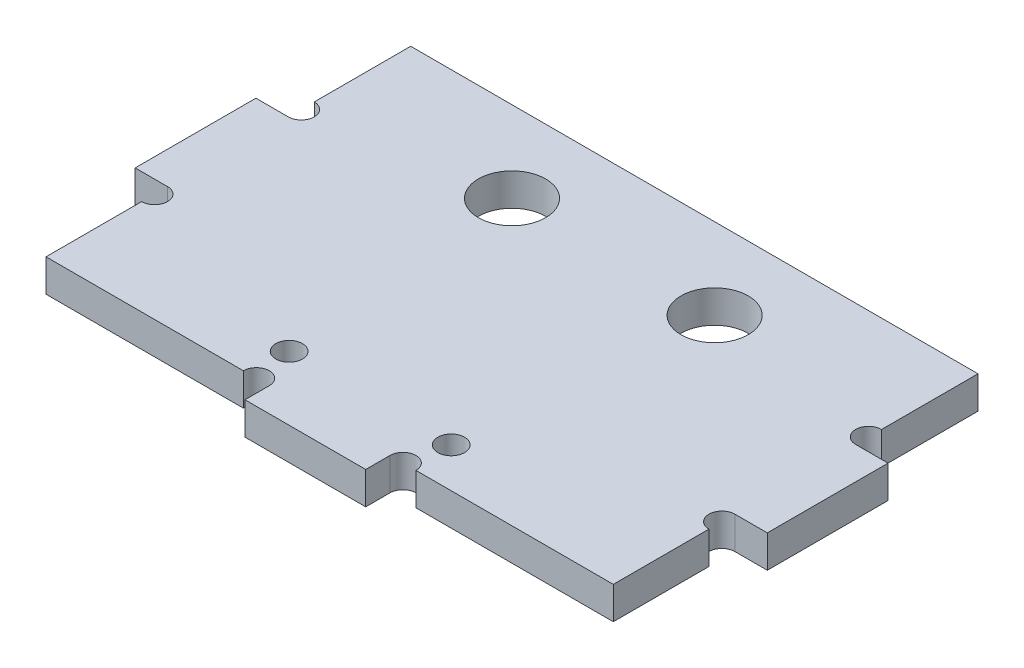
ISO-10303-21;
HEADER;
FILE_DESCRIPTION(('STEP AP214'),'2;1');
FILE_NAME('part.step','',(''),(''),'','','');
FILE_SCHEMA(('AUTOMOTIVE_DESIGN { 1 0 10303 214 1 1 1 1 }'));
ENDSEC;
DATA;
#1=APPLICATION_CONTEXT('core data for automotive mechanical design processes');
#2=APPLICATION_PROTOCOL_DEFINITION('international standard','automotive_design',2000,#1);
#3=PRODUCT_CONTEXT('',#1,'mechanical');
#4=PRODUCT('Part','Part','',(#3));
#5=PRODUCT_RELATED_PRODUCT_CATEGORY('part','',(#4));
#6=PRODUCT_DEFINITION_FORMATION('','',#4);
#7=PRODUCT_DEFINITION_CONTEXT('part definition',#1,'design');
#8=PRODUCT_DEFINITION('design','',#6,#7);
#9=PRODUCT_DEFINITION_SHAPE('','',#8);
#10=(LENGTH_UNIT() NAMED_UNIT(*) SI_UNIT(.MILLI.,.METRE.));
#11=(NAMED_UNIT(*) PLANE_ANGLE_UNIT() SI_UNIT($,.RADIAN.));
#12=(NAMED_UNIT(*) SI_UNIT($,.STERADIAN.) SOLID_ANGLE_UNIT());
#13=UNCERTAINTY_MEASURE_WITH_UNIT(LENGTH_MEASURE(1.E-05),#10,'distance_accuracy_value','');
#14=(GEOMETRIC_REPRESENTATION_CONTEXT(3) GLOBAL_UNCERTAINTY_ASSIGNED_CONTEXT((#13)) GLOBAL_UNIT_ASSIGNED_CONTEXT((#10,
#11,#12)) REPRESENTATION_CONTEXT('',''));
#15=CARTESIAN_POINT('',(0.,0.,0.));
#16=DIRECTION('',(0.,0.,1.));
#17=DIRECTION('',(1.,0.,0.));
#18=AXIS2_PLACEMENT_3D('',#15,#16,#17);
#19=CARTESIAN_POINT('',(70.,-6.,-13.4));
#20=DIRECTION('',(0.,1.,0.));
#21=DIRECTION('',(0.,0.,1.));
#22=AXIS2_PLACEMENT_3D('',#19,#20,#21);
#23=CYLINDRICAL_SURFACE('',#22,1.6);
#24=CARTESIAN_POINT('',(70.,0.,-13.4));
#25=DIRECTION('',(0.,1.,0.));
#26=DIRECTION('',(0.,0.,1.));
#27=AXIS2_PLACEMENT_3D('',#24,#25,#26);
#28=CIRCLE('',#27,1.6);
#29=CARTESIAN_POINT('',(70.,0.,-15.));
#30=VERTEX_POINT('',#29);
#31=CARTESIAN_POINT('',(70.,0.,-11.8));
#32=VERTEX_POINT('',#31);
#33=EDGE_CURVE('E243',#30,#32,#28,.T.);
#34=ORIENTED_EDGE('',*,*,#33,.F.);
#35=DIRECTION('',(0.,-1.,0.));
#36=VECTOR('',#35,1.);
#37=CARTESIAN_POINT('',(70.,4.,-15.));
#38=LINE('',#37,#36);
#39=CARTESIAN_POINT('',(70.,4.,-15.));
#40=VERTEX_POINT('',#39);
#41=EDGE_CURVE('E459',#40,#30,#38,.T.);
#42=ORIENTED_EDGE('',*,*,#41,.F.);
#43=CARTESIAN_POINT('',(70.,4.,-13.4));
#44=DIRECTION('',(0.,1.,0.));
#45=DIRECTION('',(0.,0.,1.));
#46=AXIS2_PLACEMENT_3D('',#43,#44,#45);
#47=CIRCLE('',#46,1.6);
#48=CARTESIAN_POINT('',(70.,4.,-11.8));
#49=VERTEX_POINT('',#48);
#50=EDGE_CURVE('E349',#40,#49,#47,.T.);
#51=ORIENTED_EDGE('',*,*,#50,.T.);
#52=DIRECTION('',(0.,1.,0.));
#53=VECTOR('',#52,1.);
#54=CARTESIAN_POINT('',(70.,-6.,-11.8));
#55=LINE('',#54,#53);
#56=EDGE_CURVE('E401',#32,#49,#55,.T.);
#57=ORIENTED_EDGE('',*,*,#56,.F.);
#58=EDGE_LOOP('',(#34,#42,#51,#57));
#59=FACE_BOUND('',#58,.T.);
#60=ADVANCED_FACE('F17',(#59),#23,.F.);
#61=CARTESIAN_POINT('',(70.,-6.,-31.5));
#62=DIRECTION('',(0.,1.,0.));
#63=DIRECTION('',(0.,0.,1.));
#64=AXIS2_PLACEMENT_3D('',#61,#62,#63);
#65=CYLINDRICAL_SURFACE('',#64,1.6);
#66=CARTESIAN_POINT('',(70.,0.,-31.5));
#67=DIRECTION('',(0.,1.,0.));
#68=DIRECTION('',(0.,0.,1.));
#69=AXIS2_PLACEMENT_3D('',#66,#67,#68);
#70=CIRCLE('',#69,1.6);
#71=CARTESIAN_POINT('',(70.,0.,-33.1));
#72=VERTEX_POINT('',#71);
#73=CARTESIAN_POINT('',(70.,0.,-29.9));
#74=VERTEX_POINT('',#73);
#75=EDGE_CURVE('E254',#72,#74,#70,.T.);
#76=ORIENTED_EDGE('',*,*,#75,.F.);
#77=DIRECTION('',(0.,-1.,0.));
#78=VECTOR('',#77,1.);
#79=CARTESIAN_POINT('',(70.,-6.,-33.1));
#80=LINE('',#79,#78);
#81=CARTESIAN_POINT('',(70.,4.,-33.1));
#82=VERTEX_POINT('',#81);
#83=EDGE_CURVE('E271',#82,#72,#80,.T.);
#84=ORIENTED_EDGE('',*,*,#83,.F.);
#85=CARTESIAN_POINT('',(70.,4.,-31.5));
#86=DIRECTION('',(0.,1.,0.));
#87=DIRECTION('',(0.,0.,1.));
#88=AXIS2_PLACEMENT_3D('',#85,#86,#87);
#89=CIRCLE('',#88,1.6);
#90=CARTESIAN_POINT('',(70.,4.,-29.9));
#91=VERTEX_POINT('',#90);
#92=EDGE_CURVE('E352',#82,#91,#89,.T.);
#93=ORIENTED_EDGE('',*,*,#92,.T.);
#94=DIRECTION('',(0.,-1.,0.));
#95=VECTOR('',#94,1.);
#96=CARTESIAN_POINT('',(70.,4.,-29.9));
#97=LINE('',#96,#95);
#98=EDGE_CURVE('E473',#91,#74,#97,.T.);
#99=ORIENTED_EDGE('',*,*,#98,.T.);
#100=EDGE_LOOP('',(#76,#84,#93,#99));
#101=FACE_BOUND('',#100,.T.);
#102=ADVANCED_FACE('F550',(#101),#65,.F.);
#103=CARTESIAN_POINT('',(0.,-6.,-31.5));
#104=DIRECTION('',(0.,1.,0.));
#105=DIRECTION('',(0.,0.,1.));
#106=AXIS2_PLACEMENT_3D('',#103,#104,#105);
#107=CYLINDRICAL_SURFACE('',#106,1.6);
#108=DIRECTION('',(0.,-1.,0.));
#109=VECTOR('',#108,1.);
#110=CARTESIAN_POINT('',(0.,-6.,-33.1));
#111=LINE('',#110,#109);
#112=CARTESIAN_POINT('',(0.,4.,-33.1));
#113=VERTEX_POINT('',#112);
#114=CARTESIAN_POINT('',(0.,0.,-33.1));
#115=VERTEX_POINT('',#114);
#116=EDGE_CURVE('E301',#113,#115,#111,.T.);
#117=ORIENTED_EDGE('',*,*,#116,.T.);
#118=CARTESIAN_POINT('',(0.,0.,-31.5));
#119=DIRECTION('',(0.,1.,0.));
#120=DIRECTION('',(0.,0.,1.));
#121=AXIS2_PLACEMENT_3D('',#118,#119,#120);
#122=CIRCLE('',#121,1.6);
#123=CARTESIAN_POINT('',(0.,0.,-29.9));
#124=VERTEX_POINT('',#123);
#125=EDGE_CURVE('E251',#124,#115,#122,.T.);
#126=ORIENTED_EDGE('',*,*,#125,.F.);
#127=DIRECTION('',(0.,-1.,0.));
#128=VECTOR('',#127,1.);
#129=CARTESIAN_POINT('',(0.,4.,-29.9));
#130=LINE('',#129,#128);
#131=CARTESIAN_POINT('',(0.,4.,-29.9));
#132=VERTEX_POINT('',#131);
#133=EDGE_CURVE('E287',#132,#124,#130,.T.);
#134=ORIENTED_EDGE('',*,*,#133,.F.);
#135=CARTESIAN_POINT('',(0.,4.,-31.5));
#136=DIRECTION('',(0.,1.,0.));
#137=DIRECTION('',(0.,0.,1.));
#138=AXIS2_PLACEMENT_3D('',#135,#136,#137);
#139=CIRCLE('',#138,1.6);
#140=EDGE_CURVE('E357',#132,#113,#139,.T.);
#141=ORIENTED_EDGE('',*,*,#140,.T.);
#142=EDGE_LOOP('',(#117,#126,#134,#141));
#143=FACE_BOUND('',#142,.T.);
#144=ADVANCED_FACE('F19',(#143),#107,.F.);
#145=CARTESIAN_POINT('',(0.,-6.,-13.4));
#146=DIRECTION('',(0.,1.,0.));
#147=DIRECTION('',(0.,0.,1.));
#148=AXIS2_PLACEMENT_3D('',#145,#146,#147);
#149=CYLINDRICAL_SURFACE('',#148,1.6);
#150=DIRECTION('',(0.,1.,0.));
#151=VECTOR('',#150,1.);
#152=CARTESIAN_POINT('',(0.,-6.,-11.8));
#153=LINE('',#152,#151);
#154=CARTESIAN_POINT('',(0.,0.,-11.8));
#155=VERTEX_POINT('',#154);
#156=CARTESIAN_POINT('',(0.,4.,-11.8));
#157=VERTEX_POINT('',#156);
#158=EDGE_CURVE('E337',#155,#157,#153,.T.);
#159=ORIENTED_EDGE('',*,*,#158,.T.);
#160=CARTESIAN_POINT('',(0.,4.,-13.4));
#161=DIRECTION('',(0.,1.,0.));
#162=DIRECTION('',(0.,0.,1.));
#163=AXIS2_PLACEMENT_3D('',#160,#161,#162);
#164=CIRCLE('',#163,1.6);
#165=CARTESIAN_POINT('',(0.,4.,-15.));
#166=VERTEX_POINT('',#165);
#167=EDGE_CURVE('E358',#157,#166,#164,.T.);
#168=ORIENTED_EDGE('',*,*,#167,.T.);
#169=DIRECTION('',(0.,-1.,0.));
#170=VECTOR('',#169,1.);
#171=CARTESIAN_POINT('',(0.,4.,-15.));
#172=LINE('',#171,#170);
#173=CARTESIAN_POINT('',(0.,0.,-15.));
#174=VERTEX_POINT('',#173);
#175=EDGE_CURVE('E329',#166,#174,#172,.T.);
#176=ORIENTED_EDGE('',*,*,#175,.T.);
#177=CARTESIAN_POINT('',(0.,0.,-13.4));
#178=DIRECTION('',(0.,1.,0.));
#179=DIRECTION('',(0.,0.,1.));
#180=AXIS2_PLACEMENT_3D('',#177,#178,#179);
#181=CIRCLE('',#180,1.6);
#182=EDGE_CURVE('E250',#155,#174,#181,.T.);
#183=ORIENTED_EDGE('',*,*,#182,.F.);
#184=EDGE_LOOP('',(#159,#168,#176,#183));
#185=FACE_BOUND('',#184,.T.);
#186=ADVANCED_FACE('F559',(#185),#149,.F.);
#187=CARTESIAN_POINT('',(25.95,-6.,0.));
#188=DIRECTION('',(0.,1.,0.));
#189=DIRECTION('',(0.,0.,1.));
#190=AXIS2_PLACEMENT_3D('',#187,#188,#189);
#191=CYLINDRICAL_SURFACE('',#190,1.6);
#192=CARTESIAN_POINT('',(25.95,0.,0.));
#193=DIRECTION('',(0.,1.,0.));
#194=DIRECTION('',(0.,0.,1.));
#195=AXIS2_PLACEMENT_3D('',#192,#193,#194);
#196=CIRCLE('',#195,1.6);
#197=CARTESIAN_POINT('',(27.55,0.,0.));
#198=VERTEX_POINT('',#197);
#199=CARTESIAN_POINT('',(24.35,0.,0.));
#200=VERTEX_POINT('',#199);
#201=EDGE_CURVE('E247',#198,#200,#196,.T.);
#202=ORIENTED_EDGE('',*,*,#201,.F.);
#203=DIRECTION('',(0.,1.,0.));
#204=VECTOR('',#203,1.);
#205=CARTESIAN_POINT('',(27.55,0.,0.));
#206=LINE('',#205,#204);
#207=CARTESIAN_POINT('',(27.55,4.,0.));
#208=VERTEX_POINT('',#207);
#209=EDGE_CURVE('E40',#198,#208,#206,.T.);
#210=ORIENTED_EDGE('',*,*,#209,.T.);
#211=CARTESIAN_POINT('',(25.95,4.,0.));
#212=DIRECTION('',(0.,1.,0.));
#213=DIRECTION('',(0.,0.,1.));
#214=AXIS2_PLACEMENT_3D('',#211,#212,#213);
#215=CIRCLE('',#214,1.6);
#216=CARTESIAN_POINT('',(24.35,4.,0.));
#217=VERTEX_POINT('',#216);
#218=EDGE_CURVE('E361',#208,#217,#215,.T.);
#219=ORIENTED_EDGE('',*,*,#218,.T.);
#220=DIRECTION('',(0.,1.,0.));
#221=VECTOR('',#220,1.);
#222=CARTESIAN_POINT('',(24.35,-6.,0.));
#223=LINE('',#222,#221);
#224=EDGE_CURVE('E433',#200,#217,#223,.T.);
#225=ORIENTED_EDGE('',*,*,#224,.F.);
#226=EDGE_LOOP('',(#202,#210,#219,#225));
#227=FACE_BOUND('',#226,.T.);
#228=ADVANCED_FACE('F561',(#227),#191,.F.);
#229=CARTESIAN_POINT('',(44.05,-6.,0.));
#230=DIRECTION('',(0.,1.,0.));
#231=DIRECTION('',(0.,0.,1.));
#232=AXIS2_PLACEMENT_3D('',#229,#230,#231);
#233=CYLINDRICAL_SURFACE('',#232,1.6);
#234=CARTESIAN_POINT('',(44.05,4.,0.));
#235=DIRECTION('',(0.,1.,0.));
#236=DIRECTION('',(0.,0.,1.));
#237=AXIS2_PLACEMENT_3D('',#234,#235,#236);
#238=CIRCLE('',#237,1.6);
#239=CARTESIAN_POINT('',(45.65,4.,0.));
#240=VERTEX_POINT('',#239);
#241=CARTESIAN_POINT('',(42.45,4.,0.));
#242=VERTEX_POINT('',#241);
#243=EDGE_CURVE('E366',#240,#242,#238,.T.);
#244=ORIENTED_EDGE('',*,*,#243,.T.);
#245=DIRECTION('',(0.,1.,0.));
#246=VECTOR('',#245,1.);
#247=CARTESIAN_POINT('',(42.45,0.,0.));
#248=LINE('',#247,#246);
#249=CARTESIAN_POINT('',(42.45,0.,0.));
#250=VERTEX_POINT('',#249);
#251=EDGE_CURVE('E11',#250,#242,#248,.T.);
#252=ORIENTED_EDGE('',*,*,#251,.F.);
#253=CARTESIAN_POINT('',(44.05,0.,0.));
#254=DIRECTION('',(0.,1.,0.));
#255=DIRECTION('',(0.,0.,1.));
#256=AXIS2_PLACEMENT_3D('',#253,#254,#255);
#257=CIRCLE('',#256,1.6);
#258=CARTESIAN_POINT('',(45.65,0.,0.));
#259=VERTEX_POINT('',#258);
#260=EDGE_CURVE('E236',#259,#250,#257,.T.);
#261=ORIENTED_EDGE('',*,*,#260,.F.);
#262=DIRECTION('',(0.,-1.,0.));
#263=VECTOR('',#262,1.);
#264=CARTESIAN_POINT('',(45.65,-6.,0.));
#265=LINE('',#264,#263);
#266=EDGE_CURVE('E407',#240,#259,#265,.T.);
#267=ORIENTED_EDGE('',*,*,#266,.F.);
#268=EDGE_LOOP('',(#244,#252,#261,#267));
#269=FACE_BOUND('',#268,.T.);
#270=ADVANCED_FACE('F557',(#269),#233,.F.);
#271=CARTESIAN_POINT('',(27.55,0.,3.));
#272=DIRECTION('',(0.,0.,1.));
#273=DIRECTION('',(1.,0.,0.));
#274=AXIS2_PLACEMENT_3D('',#271,#272,#273);
#275=PLANE('',#274);
#276=DIRECTION('',(1.,0.,0.));
#277=VECTOR('',#276,1.);
#278=CARTESIAN_POINT('',(27.55,4.,3.));
#279=LINE('',#278,#277);
#280=CARTESIAN_POINT('',(27.55,4.,3.));
#281=VERTEX_POINT('',#280);
#282=CARTESIAN_POINT('',(42.45,4.,3.));
#283=VERTEX_POINT('',#282);
#284=EDGE_CURVE('E367',#281,#283,#279,.T.);
#285=ORIENTED_EDGE('',*,*,#284,.F.);
#286=DIRECTION('',(0.,1.,0.));
#287=VECTOR('',#286,1.);
#288=CARTESIAN_POINT('',(27.55,0.,3.));
#289=LINE('',#288,#287);
#290=CARTESIAN_POINT('',(27.55,0.,3.));
#291=VERTEX_POINT('',#290);
#292=EDGE_CURVE('E224',#291,#281,#289,.T.);
#293=ORIENTED_EDGE('',*,*,#292,.F.);
#294=DIRECTION('',(1.,0.,0.));
#295=VECTOR('',#294,1.);
#296=CARTESIAN_POINT('',(27.55,0.,3.));
#297=LINE('',#296,#295);
#298=CARTESIAN_POINT('',(42.45,0.,3.));
#299=VERTEX_POINT('',#298);
#300=EDGE_CURVE('E226',#291,#299,#297,.T.);
#301=ORIENTED_EDGE('',*,*,#300,.T.);
#302=DIRECTION('',(0.,1.,0.));
#303=VECTOR('',#302,1.);
#304=CARTESIAN_POINT('',(42.45,0.,3.));
#305=LINE('',#304,#303);
#306=EDGE_CURVE('E27',#299,#283,#305,.T.);
#307=ORIENTED_EDGE('',*,*,#306,.T.);
#308=EDGE_LOOP('',(#285,#293,#301,#307));
#309=FACE_BOUND('',#308,.T.);
#310=ADVANCED_FACE('F227',(#309),#275,.T.);
#311=CARTESIAN_POINT('',(42.45,0.,0.));
#312=DIRECTION('',(1.,0.,0.));
#313=DIRECTION('',(0.,1.,0.));
#314=AXIS2_PLACEMENT_3D('',#311,#312,#313);
#315=PLANE('',#314);
#316=DIRECTION('',(0.,0.,-1.));
#317=VECTOR('',#316,1.);
#318=CARTESIAN_POINT('',(42.45,4.,0.));
#319=LINE('',#318,#317);
#320=EDGE_CURVE('E219',#283,#242,#319,.T.);
#321=ORIENTED_EDGE('',*,*,#320,.F.);
#322=ORIENTED_EDGE('',*,*,#306,.F.);
#323=DIRECTION('',(0.,0.,-1.));
#324=VECTOR('',#323,1.);
#325=CARTESIAN_POINT('',(42.45,0.,0.));
#326=LINE('',#325,#324);
#327=EDGE_CURVE('E216',#299,#250,#326,.T.);
#328=ORIENTED_EDGE('',*,*,#327,.T.);
#329=ORIENTED_EDGE('',*,*,#251,.T.);
#330=EDGE_LOOP('',(#321,#322,#328,#329));
#331=FACE_BOUND('',#330,.T.);
#332=ADVANCED_FACE('F214',(#331),#315,.T.);
#333=CARTESIAN_POINT('',(27.55,0.,0.));
#334=DIRECTION('',(-1.,0.,0.));
#335=DIRECTION('',(0.,0.,1.));
#336=AXIS2_PLACEMENT_3D('',#333,#334,#335);
#337=PLANE('',#336);
#338=DIRECTION('',(0.,0.,1.));
#339=VECTOR('',#338,1.);
#340=CARTESIAN_POINT('',(27.55,4.,0.));
#341=LINE('',#340,#339);
#342=EDGE_CURVE('E364',#208,#281,#341,.T.);
#343=ORIENTED_EDGE('',*,*,#342,.F.);
#344=ORIENTED_EDGE('',*,*,#209,.F.);
#345=DIRECTION('',(0.,0.,1.));
#346=VECTOR('',#345,1.);
#347=CARTESIAN_POINT('',(27.55,0.,0.));
#348=LINE('',#347,#346);
#349=EDGE_CURVE('E231',#198,#291,#348,.T.);
#350=ORIENTED_EDGE('',*,*,#349,.T.);
#351=ORIENTED_EDGE('',*,*,#292,.T.);
#352=EDGE_LOOP('',(#343,#344,#350,#351));
#353=FACE_BOUND('',#352,.T.);
#354=ADVANCED_FACE('F587',(#353),#337,.T.);
#355=CARTESIAN_POINT('',(0.,0.,0.));
#356=DIRECTION('',(0.,1.,0.));
#357=DIRECTION('',(1.,0.,0.));
#358=AXIS2_PLACEMENT_3D('',#355,#356,#357);
#359=PLANE('',#358);
#360=CARTESIAN_POINT('',(22.5,0.,-35.));
#361=DIRECTION('',(0.,1.,0.));
#362=DIRECTION('',(0.,0.,1.));
#363=AXIS2_PLACEMENT_3D('',#360,#361,#362);
#364=CIRCLE('',#363,4.15);
#365=CARTESIAN_POINT('',(22.5,0.,-30.85));
#366=VERTEX_POINT('',#365);
#367=EDGE_CURVE('E381',#366,#366,#364,.T.);
#368=ORIENTED_EDGE('',*,*,#367,.T.);
#369=EDGE_LOOP('',(#368));
#370=FACE_BOUND('',#369,.T.);
#371=CARTESIAN_POINT('',(47.5,0.,-35.));
#372=DIRECTION('',(0.,1.,0.));
#373=DIRECTION('',(0.,0.,1.));
#374=AXIS2_PLACEMENT_3D('',#371,#372,#373);
#375=CIRCLE('',#374,4.15);
#376=CARTESIAN_POINT('',(47.5,0.,-30.85));
#377=VERTEX_POINT('',#376);
#378=EDGE_CURVE('E389',#377,#377,#375,.T.);
#379=ORIENTED_EDGE('',*,*,#378,.T.);
#380=EDGE_LOOP('',(#379));
#381=FACE_BOUND('',#380,.T.);
#382=CARTESIAN_POINT('',(45.100000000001,0.,-4.90000000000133));
#383=DIRECTION('',(0.,1.,0.));
#384=DIRECTION('',(0.,0.,1.));
#385=AXIS2_PLACEMENT_3D('',#382,#383,#384);
#386=CIRCLE('',#385,1.65);
#387=CARTESIAN_POINT('',(45.100000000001,0.,-3.25000000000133));
#388=VERTEX_POINT('',#387);
#389=EDGE_CURVE('E506',#388,#388,#386,.T.);
#390=ORIENTED_EDGE('',*,*,#389,.T.);
#391=EDGE_LOOP('',(#390));
#392=FACE_BOUND('',#391,.T.);
#393=CARTESIAN_POINT('',(25.100000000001,0.,-4.90000000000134));
#394=DIRECTION('',(0.,1.,0.));
#395=DIRECTION('',(0.,0.,1.));
#396=AXIS2_PLACEMENT_3D('',#393,#394,#395);
#397=CIRCLE('',#396,1.65);
#398=CARTESIAN_POINT('',(25.100000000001,0.,-3.25000000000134));
#399=VERTEX_POINT('',#398);
#400=EDGE_CURVE('E490',#399,#399,#397,.T.);
#401=ORIENTED_EDGE('',*,*,#400,.T.);
#402=EDGE_LOOP('',(#401));
#403=FACE_BOUND('',#402,.T.);
#404=DIRECTION('',(1.,0.,0.));
#405=VECTOR('',#404,1.);
#406=CARTESIAN_POINT('',(0.,0.,-15.));
#407=LINE('',#406,#405);
#408=CARTESIAN_POINT('',(74.,0.,-15.));
#409=VERTEX_POINT('',#408);
#410=EDGE_CURVE('E447',#30,#409,#407,.T.);
#411=ORIENTED_EDGE('',*,*,#410,.F.);
#412=ORIENTED_EDGE('',*,*,#33,.T.);
#413=DIRECTION('',(0.,0.,-1.));
#414=VECTOR('',#413,1.);
#415=CARTESIAN_POINT('',(70.,0.,0.));
#416=LINE('',#415,#414);
#417=CARTESIAN_POINT('',(70.,0.,0.));
#418=VERTEX_POINT('',#417);
#419=EDGE_CURVE('E397',#418,#32,#416,.T.);
#420=ORIENTED_EDGE('',*,*,#419,.F.);
#421=DIRECTION('',(1.,0.,0.));
#422=VECTOR('',#421,1.);
#423=CARTESIAN_POINT('',(0.,0.,0.));
#424=LINE('',#423,#422);
#425=EDGE_CURVE('E412',#259,#418,#424,.T.);
#426=ORIENTED_EDGE('',*,*,#425,.F.);
#427=ORIENTED_EDGE('',*,*,#260,.T.);
#428=ORIENTED_EDGE('',*,*,#327,.F.);
#429=ORIENTED_EDGE('',*,*,#300,.F.);
#430=ORIENTED_EDGE('',*,*,#349,.F.);
#431=ORIENTED_EDGE('',*,*,#201,.T.);
#432=DIRECTION('',(1.,0.,0.));
#433=VECTOR('',#432,1.);
#434=CARTESIAN_POINT('',(0.,0.,0.));
#435=LINE('',#434,#433);
#436=CARTESIAN_POINT('',(0.,0.,0.));
#437=VERTEX_POINT('',#436);
#438=EDGE_CURVE('E429',#437,#200,#435,.T.);
#439=ORIENTED_EDGE('',*,*,#438,.F.);
#440=DIRECTION('',(0.,0.,-1.));
#441=VECTOR('',#440,1.);
#442=CARTESIAN_POINT('',(0.,0.,0.));
#443=LINE('',#442,#441);
#444=EDGE_CURVE('E341',#437,#155,#443,.T.);
#445=ORIENTED_EDGE('',*,*,#444,.T.);
#446=ORIENTED_EDGE('',*,*,#182,.T.);
#447=DIRECTION('',(-1.,0.,0.));
#448=VECTOR('',#447,1.);
#449=CARTESIAN_POINT('',(0.,0.,-15.));
#450=LINE('',#449,#448);
#451=CARTESIAN_POINT('',(-4.,0.,-15.));
#452=VERTEX_POINT('',#451);
#453=EDGE_CURVE('E327',#174,#452,#450,.T.);
#454=ORIENTED_EDGE('',*,*,#453,.T.);
#455=DIRECTION('',(0.,0.,-1.));
#456=VECTOR('',#455,1.);
#457=CARTESIAN_POINT('',(-4.,0.,0.));
#458=LINE('',#457,#456);
#459=CARTESIAN_POINT('',(-4.,0.,-29.9));
#460=VERTEX_POINT('',#459);
#461=EDGE_CURVE('E291',#452,#460,#458,.T.);
#462=ORIENTED_EDGE('',*,*,#461,.T.);
#463=DIRECTION('',(-1.,0.,0.));
#464=VECTOR('',#463,1.);
#465=CARTESIAN_POINT('',(0.,0.,-29.9));
#466=LINE('',#465,#464);
#467=EDGE_CURVE('E311',#124,#460,#466,.T.);
#468=ORIENTED_EDGE('',*,*,#467,.F.);
#469=ORIENTED_EDGE('',*,*,#125,.T.);
#470=DIRECTION('',(0.,0.,-1.));
#471=VECTOR('',#470,1.);
#472=CARTESIAN_POINT('',(0.,0.,0.));
#473=LINE('',#472,#471);
#474=CARTESIAN_POINT('',(0.,0.,-45.));
#475=VERTEX_POINT('',#474);
#476=EDGE_CURVE('E308',#115,#475,#473,.T.);
#477=ORIENTED_EDGE('',*,*,#476,.T.);
#478=DIRECTION('',(1.,0.,0.));
#479=VECTOR('',#478,1.);
#480=CARTESIAN_POINT('',(0.,0.,-45.));
#481=LINE('',#480,#479);
#482=CARTESIAN_POINT('',(70.,0.,-45.));
#483=VERTEX_POINT('',#482);
#484=EDGE_CURVE('E283',#475,#483,#481,.T.);
#485=ORIENTED_EDGE('',*,*,#484,.T.);
#486=DIRECTION('',(0.,0.,-1.));
#487=VECTOR('',#486,1.);
#488=CARTESIAN_POINT('',(70.,0.,0.));
#489=LINE('',#488,#487);
#490=EDGE_CURVE('E275',#72,#483,#489,.T.);
#491=ORIENTED_EDGE('',*,*,#490,.F.);
#492=ORIENTED_EDGE('',*,*,#75,.T.);
#493=DIRECTION('',(1.,0.,0.));
#494=VECTOR('',#493,1.);
#495=CARTESIAN_POINT('',(0.,0.,-29.9));
#496=LINE('',#495,#494);
#497=CARTESIAN_POINT('',(74.,0.,-29.9));
#498=VERTEX_POINT('',#497);
#499=EDGE_CURVE('E471',#74,#498,#496,.T.);
#500=ORIENTED_EDGE('',*,*,#499,.T.);
#501=DIRECTION('',(0.,0.,-1.));
#502=VECTOR('',#501,1.);
#503=CARTESIAN_POINT('',(74.,0.,0.));
#504=LINE('',#503,#502);
#505=EDGE_CURVE('E388',#409,#498,#504,.T.);
#506=ORIENTED_EDGE('',*,*,#505,.F.);
#507=EDGE_LOOP('',(#411,#412,#420,#426,#427,#428,#429,#430,#431,#439,#445,#446,#454,#462,#468,
#469,#477,#485,#491,#492,#500,#506));
#508=FACE_BOUND('',#507,.T.);
#509=ADVANCED_FACE('F234',(#370,#381,#392,#403,#508),#359,.F.);
#510=CARTESIAN_POINT('',(0.,4.,0.));
#511=DIRECTION('',(0.,1.,0.));
#512=DIRECTION('',(1.,0.,0.));
#513=AXIS2_PLACEMENT_3D('',#510,#511,#512);
#514=PLANE('',#513);
#515=CARTESIAN_POINT('',(22.5,4.,-35.));
#516=DIRECTION('',(0.,1.,0.));
#517=DIRECTION('',(0.,0.,1.));
#518=AXIS2_PLACEMENT_3D('',#515,#516,#517);
#519=CIRCLE('',#518,4.15);
#520=CARTESIAN_POINT('',(22.5,4.,-30.85));
#521=VERTEX_POINT('',#520);
#522=EDGE_CURVE('E408',#521,#521,#519,.T.);
#523=ORIENTED_EDGE('',*,*,#522,.F.);
#524=EDGE_LOOP('',(#523));
#525=FACE_BOUND('',#524,.T.);
#526=CARTESIAN_POINT('',(47.5,4.,-35.));
#527=DIRECTION('',(0.,1.,0.));
#528=DIRECTION('',(0.,0.,1.));
#529=AXIS2_PLACEMENT_3D('',#526,#527,#528);
#530=CIRCLE('',#529,4.15);
#531=CARTESIAN_POINT('',(47.5,4.,-30.85));
#532=VERTEX_POINT('',#531);
#533=EDGE_CURVE('E393',#532,#532,#530,.T.);
#534=ORIENTED_EDGE('',*,*,#533,.F.);
#535=EDGE_LOOP('',(#534));
#536=FACE_BOUND('',#535,.T.);
#537=CARTESIAN_POINT('',(45.100000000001,4.,-4.90000000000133));
#538=DIRECTION('',(0.,1.,0.));
#539=DIRECTION('',(0.,0.,1.));
#540=AXIS2_PLACEMENT_3D('',#537,#538,#539);
#541=CIRCLE('',#540,1.65);
#542=CARTESIAN_POINT('',(45.100000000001,4.,-3.25000000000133));
#543=VERTEX_POINT('',#542);
#544=EDGE_CURVE('E394',#543,#543,#541,.T.);
#545=ORIENTED_EDGE('',*,*,#544,.F.);
#546=EDGE_LOOP('',(#545));
#547=FACE_BOUND('',#546,.T.);
#548=CARTESIAN_POINT('',(25.100000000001,4.,-4.90000000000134));
#549=DIRECTION('',(0.,1.,0.));
#550=DIRECTION('',(0.,0.,1.));
#551=AXIS2_PLACEMENT_3D('',#548,#549,#550);
#552=CIRCLE('',#551,1.65);
#553=CARTESIAN_POINT('',(25.100000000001,4.,-3.25000000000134));
#554=VERTEX_POINT('',#553);
#555=EDGE_CURVE('E494',#554,#554,#552,.T.);
#556=ORIENTED_EDGE('',*,*,#555,.F.);
#557=EDGE_LOOP('',(#556));
#558=FACE_BOUND('',#557,.T.);
#559=ORIENTED_EDGE('',*,*,#50,.F.);
#560=DIRECTION('',(1.,0.,0.));
#561=VECTOR('',#560,1.);
#562=CARTESIAN_POINT('',(0.,4.,-15.));
#563=LINE('',#562,#561);
#564=CARTESIAN_POINT('',(74.,4.,-15.));
#565=VERTEX_POINT('',#564);
#566=EDGE_CURVE('E455',#40,#565,#563,.T.);
#567=ORIENTED_EDGE('',*,*,#566,.T.);
#568=DIRECTION('',(0.,0.,-1.));
#569=VECTOR('',#568,1.);
#570=CARTESIAN_POINT('',(74.,4.,0.));
#571=LINE('',#570,#569);
#572=CARTESIAN_POINT('',(74.,4.,-29.9));
#573=VERTEX_POINT('',#572);
#574=EDGE_CURVE('E387',#565,#573,#571,.T.);
#575=ORIENTED_EDGE('',*,*,#574,.T.);
#576=DIRECTION('',(1.,0.,0.));
#577=VECTOR('',#576,1.);
#578=CARTESIAN_POINT('',(0.,4.,-29.9));
#579=LINE('',#578,#577);
#580=EDGE_CURVE('E475',#91,#573,#579,.T.);
#581=ORIENTED_EDGE('',*,*,#580,.F.);
#582=ORIENTED_EDGE('',*,*,#92,.F.);
#583=DIRECTION('',(0.,0.,-1.));
#584=VECTOR('',#583,1.);
#585=CARTESIAN_POINT('',(70.,4.,0.));
#586=LINE('',#585,#584);
#587=CARTESIAN_POINT('',(70.,4.,-45.));
#588=VERTEX_POINT('',#587);
#589=EDGE_CURVE('E269',#82,#588,#586,.T.);
#590=ORIENTED_EDGE('',*,*,#589,.T.);
#591=DIRECTION('',(1.,0.,0.));
#592=VECTOR('',#591,1.);
#593=CARTESIAN_POINT('',(0.,4.,-45.));
#594=LINE('',#593,#592);
#595=CARTESIAN_POINT('',(0.,4.,-45.));
#596=VERTEX_POINT('',#595);
#597=EDGE_CURVE('E296',#596,#588,#594,.T.);
#598=ORIENTED_EDGE('',*,*,#597,.F.);
#599=DIRECTION('',(0.,0.,-1.));
#600=VECTOR('',#599,1.);
#601=CARTESIAN_POINT('',(0.,4.,0.));
#602=LINE('',#601,#600);
#603=EDGE_CURVE('E305',#113,#596,#602,.T.);
#604=ORIENTED_EDGE('',*,*,#603,.F.);
#605=ORIENTED_EDGE('',*,*,#140,.F.);
#606=DIRECTION('',(-1.,0.,0.));
#607=VECTOR('',#606,1.);
#608=CARTESIAN_POINT('',(0.,4.,-29.9));
#609=LINE('',#608,#607);
#610=CARTESIAN_POINT('',(-4.,4.,-29.9));
#611=VERTEX_POINT('',#610);
#612=EDGE_CURVE('E292',#132,#611,#609,.T.);
#613=ORIENTED_EDGE('',*,*,#612,.T.);
#614=DIRECTION('',(0.,0.,-1.));
#615=VECTOR('',#614,1.);
#616=CARTESIAN_POINT('',(-4.,4.,0.));
#617=LINE('',#616,#615);
#618=CARTESIAN_POINT('',(-4.,4.,-15.));
#619=VERTEX_POINT('',#618);
#620=EDGE_CURVE('E324',#619,#611,#617,.T.);
#621=ORIENTED_EDGE('',*,*,#620,.F.);
#622=DIRECTION('',(-1.,0.,0.));
#623=VECTOR('',#622,1.);
#624=CARTESIAN_POINT('',(0.,4.,-15.));
#625=LINE('',#624,#623);
#626=EDGE_CURVE('E334',#166,#619,#625,.T.);
#627=ORIENTED_EDGE('',*,*,#626,.F.);
#628=ORIENTED_EDGE('',*,*,#167,.F.);
#629=DIRECTION('',(0.,0.,-1.));
#630=VECTOR('',#629,1.);
#631=CARTESIAN_POINT('',(0.,4.,0.));
#632=LINE('',#631,#630);
#633=CARTESIAN_POINT('',(0.,4.,0.));
#634=VERTEX_POINT('',#633);
#635=EDGE_CURVE('E345',#634,#157,#632,.T.);
#636=ORIENTED_EDGE('',*,*,#635,.F.);
#637=DIRECTION('',(1.,0.,0.));
#638=VECTOR('',#637,1.);
#639=CARTESIAN_POINT('',(0.,4.,0.));
#640=LINE('',#639,#638);
#641=EDGE_CURVE('E416',#634,#217,#640,.T.);
#642=ORIENTED_EDGE('',*,*,#641,.T.);
#643=ORIENTED_EDGE('',*,*,#218,.F.);
#644=ORIENTED_EDGE('',*,*,#342,.T.);
#645=ORIENTED_EDGE('',*,*,#284,.T.);
#646=ORIENTED_EDGE('',*,*,#320,.T.);
#647=ORIENTED_EDGE('',*,*,#243,.F.);
#648=DIRECTION('',(1.,0.,0.));
#649=VECTOR('',#648,1.);
#650=CARTESIAN_POINT('',(0.,4.,0.));
#651=LINE('',#650,#649);
#652=CARTESIAN_POINT('',(70.,4.,0.));
#653=VERTEX_POINT('',#652);
#654=EDGE_CURVE('E403',#240,#653,#651,.T.);
#655=ORIENTED_EDGE('',*,*,#654,.T.);
#656=DIRECTION('',(0.,0.,-1.));
#657=VECTOR('',#656,1.);
#658=CARTESIAN_POINT('',(70.,4.,0.));
#659=LINE('',#658,#657);
#660=EDGE_CURVE('E443',#653,#49,#659,.T.);
#661=ORIENTED_EDGE('',*,*,#660,.T.);
#662=EDGE_LOOP('',(#559,#567,#575,#581,#582,#590,#598,#604,#605,#613,#621,#627,#628,#636,#642,
#643,#644,#645,#646,#647,#655,#661));
#663=FACE_BOUND('',#662,.T.);
#664=ADVANCED_FACE('F518',(#525,#536,#547,#558,#663),#514,.T.);
#665=CARTESIAN_POINT('',(0.,4.,0.));
#666=DIRECTION('',(-1.,0.,0.));
#667=DIRECTION('',(0.,0.,1.));
#668=AXIS2_PLACEMENT_3D('',#665,#666,#667);
#669=PLANE('',#668);
#670=ORIENTED_EDGE('',*,*,#158,.F.);
#671=ORIENTED_EDGE('',*,*,#444,.F.);
#672=DIRECTION('',(0.,-1.,0.));
#673=VECTOR('',#672,1.);
#674=CARTESIAN_POINT('',(0.,4.,0.));
#675=LINE('',#674,#673);
#676=EDGE_CURVE('E402',#634,#437,#675,.T.);
#677=ORIENTED_EDGE('',*,*,#676,.F.);
#678=ORIENTED_EDGE('',*,*,#635,.T.);
#679=EDGE_LOOP('',(#670,#671,#677,#678));
#680=FACE_BOUND('',#679,.T.);
#681=ADVANCED_FACE('F521',(#680),#669,.T.);
#682=CARTESIAN_POINT('',(0.,4.,-15.));
#683=DIRECTION('',(0.,0.,1.));
#684=DIRECTION('',(1.,0.,0.));
#685=AXIS2_PLACEMENT_3D('',#682,#683,#684);
#686=PLANE('',#685);
#687=ORIENTED_EDGE('',*,*,#453,.F.);
#688=ORIENTED_EDGE('',*,*,#175,.F.);
#689=ORIENTED_EDGE('',*,*,#626,.T.);
#690=DIRECTION('',(0.,-1.,0.));
#691=VECTOR('',#690,1.);
#692=CARTESIAN_POINT('',(-4.,4.,-15.));
#693=LINE('',#692,#691);
#694=EDGE_CURVE('E320',#619,#452,#693,.T.);
#695=ORIENTED_EDGE('',*,*,#694,.T.);
#696=EDGE_LOOP('',(#687,#688,#689,#695));
#697=FACE_BOUND('',#696,.T.);
#698=ADVANCED_FACE('F580',(#697),#686,.T.);
#699=CARTESIAN_POINT('',(-4.,4.,0.));
#700=DIRECTION('',(-1.,0.,0.));
#701=DIRECTION('',(0.,0.,1.));
#702=AXIS2_PLACEMENT_3D('',#699,#700,#701);
#703=PLANE('',#702);
#704=ORIENTED_EDGE('',*,*,#461,.F.);
#705=ORIENTED_EDGE('',*,*,#694,.F.);
#706=ORIENTED_EDGE('',*,*,#620,.T.);
#707=DIRECTION('',(0.,-1.,0.));
#708=VECTOR('',#707,1.);
#709=CARTESIAN_POINT('',(-4.,4.,-29.9));
#710=LINE('',#709,#708);
#711=EDGE_CURVE('E300',#611,#460,#710,.T.);
#712=ORIENTED_EDGE('',*,*,#711,.T.);
#713=EDGE_LOOP('',(#704,#705,#706,#712));
#714=FACE_BOUND('',#713,.T.);
#715=ADVANCED_FACE('F1175',(#714),#703,.T.);
#716=CARTESIAN_POINT('',(0.,4.,-29.9));
#717=DIRECTION('',(0.,0.,1.));
#718=DIRECTION('',(1.,0.,0.));
#719=AXIS2_PLACEMENT_3D('',#716,#717,#718);
#720=PLANE('',#719);
#721=ORIENTED_EDGE('',*,*,#467,.T.);
#722=ORIENTED_EDGE('',*,*,#711,.F.);
#723=ORIENTED_EDGE('',*,*,#612,.F.);
#724=ORIENTED_EDGE('',*,*,#133,.T.);
#725=EDGE_LOOP('',(#721,#722,#723,#724));
#726=FACE_BOUND('',#725,.T.);
#727=ADVANCED_FACE('F1170',(#726),#720,.F.);
#728=CARTESIAN_POINT('',(0.,4.,0.));
#729=DIRECTION('',(-1.,0.,0.));
#730=DIRECTION('',(0.,0.,1.));
#731=AXIS2_PLACEMENT_3D('',#728,#729,#730);
#732=PLANE('',#731);
#733=ORIENTED_EDGE('',*,*,#116,.F.);
#734=ORIENTED_EDGE('',*,*,#603,.T.);
#735=DIRECTION('',(0.,-1.,0.));
#736=VECTOR('',#735,1.);
#737=CARTESIAN_POINT('',(0.,4.,-45.));
#738=LINE('',#737,#736);
#739=EDGE_CURVE('E286',#596,#475,#738,.T.);
#740=ORIENTED_EDGE('',*,*,#739,.T.);
#741=ORIENTED_EDGE('',*,*,#476,.F.);
#742=EDGE_LOOP('',(#733,#734,#740,#741));
#743=FACE_BOUND('',#742,.T.);
#744=ADVANCED_FACE('F1174',(#743),#732,.T.);
#745=CARTESIAN_POINT('',(0.,4.,-45.));
#746=DIRECTION('',(0.,0.,-1.));
#747=DIRECTION('',(0.,-1.,0.));
#748=AXIS2_PLACEMENT_3D('',#745,#746,#747);
#749=PLANE('',#748);
#750=ORIENTED_EDGE('',*,*,#484,.F.);
#751=ORIENTED_EDGE('',*,*,#739,.F.);
#752=ORIENTED_EDGE('',*,*,#597,.T.);
#753=DIRECTION('',(0.,-1.,0.));
#754=VECTOR('',#753,1.);
#755=CARTESIAN_POINT('',(70.,4.,-45.));
#756=LINE('',#755,#754);
#757=EDGE_CURVE('E279',#588,#483,#756,.T.);
#758=ORIENTED_EDGE('',*,*,#757,.T.);
#759=EDGE_LOOP('',(#750,#751,#752,#758));
#760=FACE_BOUND('',#759,.T.);
#761=ADVANCED_FACE('F544',(#760),#749,.T.);
#762=CARTESIAN_POINT('',(70.,4.,0.));
#763=DIRECTION('',(-1.,0.,0.));
#764=DIRECTION('',(0.,0.,1.));
#765=AXIS2_PLACEMENT_3D('',#762,#763,#764);
#766=PLANE('',#765);
#767=ORIENTED_EDGE('',*,*,#589,.F.);
#768=ORIENTED_EDGE('',*,*,#83,.T.);
#769=ORIENTED_EDGE('',*,*,#490,.T.);
#770=ORIENTED_EDGE('',*,*,#757,.F.);
#771=EDGE_LOOP('',(#767,#768,#769,#770));
#772=FACE_BOUND('',#771,.T.);
#773=ADVANCED_FACE('F536',(#772),#766,.F.);
#774=CARTESIAN_POINT('',(0.,4.,-29.9));
#775=DIRECTION('',(0.,0.,-1.));
#776=DIRECTION('',(0.,-1.,0.));
#777=AXIS2_PLACEMENT_3D('',#774,#775,#776);
#778=PLANE('',#777);
#779=ORIENTED_EDGE('',*,*,#499,.F.);
#780=ORIENTED_EDGE('',*,*,#98,.F.);
#781=ORIENTED_EDGE('',*,*,#580,.T.);
#782=DIRECTION('',(0.,-1.,0.));
#783=VECTOR('',#782,1.);
#784=CARTESIAN_POINT('',(74.,4.,-29.9));
#785=LINE('',#784,#783);
#786=EDGE_CURVE('E383',#573,#498,#785,.T.);
#787=ORIENTED_EDGE('',*,*,#786,.T.);
#788=EDGE_LOOP('',(#779,#780,#781,#787));
#789=FACE_BOUND('',#788,.T.);
#790=ADVANCED_FACE('F534',(#789),#778,.T.);
#791=CARTESIAN_POINT('',(74.,4.,0.));
#792=DIRECTION('',(-1.,0.,0.));
#793=DIRECTION('',(0.,0.,1.));
#794=AXIS2_PLACEMENT_3D('',#791,#792,#793);
#795=PLANE('',#794);
#796=ORIENTED_EDGE('',*,*,#505,.T.);
#797=ORIENTED_EDGE('',*,*,#786,.F.);
#798=ORIENTED_EDGE('',*,*,#574,.F.);
#799=DIRECTION('',(0.,-1.,0.));
#800=VECTOR('',#799,1.);
#801=CARTESIAN_POINT('',(74.,4.,-15.));
#802=LINE('',#801,#800);
#803=EDGE_CURVE('E451',#565,#409,#802,.T.);
#804=ORIENTED_EDGE('',*,*,#803,.T.);
#805=EDGE_LOOP('',(#796,#797,#798,#804));
#806=FACE_BOUND('',#805,.T.);
#807=ADVANCED_FACE('F531',(#806),#795,.F.);
#808=CARTESIAN_POINT('',(0.,4.,-15.));
#809=DIRECTION('',(0.,0.,-1.));
#810=DIRECTION('',(0.,-1.,0.));
#811=AXIS2_PLACEMENT_3D('',#808,#809,#810);
#812=PLANE('',#811);
#813=ORIENTED_EDGE('',*,*,#410,.T.);
#814=ORIENTED_EDGE('',*,*,#803,.F.);
#815=ORIENTED_EDGE('',*,*,#566,.F.);
#816=ORIENTED_EDGE('',*,*,#41,.T.);
#817=EDGE_LOOP('',(#813,#814,#815,#816));
#818=FACE_BOUND('',#817,.T.);
#819=ADVANCED_FACE('F529',(#818),#812,.F.);
#820=CARTESIAN_POINT('',(70.,4.,0.));
#821=DIRECTION('',(-1.,0.,0.));
#822=DIRECTION('',(0.,0.,1.));
#823=AXIS2_PLACEMENT_3D('',#820,#821,#822);
#824=PLANE('',#823);
#825=ORIENTED_EDGE('',*,*,#419,.T.);
#826=ORIENTED_EDGE('',*,*,#56,.T.);
#827=ORIENTED_EDGE('',*,*,#660,.F.);
#828=DIRECTION('',(0.,-1.,0.));
#829=VECTOR('',#828,1.);
#830=CARTESIAN_POINT('',(70.,4.,0.));
#831=LINE('',#830,#829);
#832=EDGE_CURVE('E420',#653,#418,#831,.T.);
#833=ORIENTED_EDGE('',*,*,#832,.T.);
#834=EDGE_LOOP('',(#825,#826,#827,#833));
#835=FACE_BOUND('',#834,.T.);
#836=ADVANCED_FACE('F1208',(#835),#824,.F.);
#837=CARTESIAN_POINT('',(0.,4.,0.));
#838=DIRECTION('',(0.,0.,-1.));
#839=DIRECTION('',(0.,-1.,0.));
#840=AXIS2_PLACEMENT_3D('',#837,#838,#839);
#841=PLANE('',#840);
#842=ORIENTED_EDGE('',*,*,#438,.T.);
#843=ORIENTED_EDGE('',*,*,#224,.T.);
#844=ORIENTED_EDGE('',*,*,#641,.F.);
#845=ORIENTED_EDGE('',*,*,#676,.T.);
#846=EDGE_LOOP('',(#842,#843,#844,#845));
#847=FACE_BOUND('',#846,.T.);
#848=ADVANCED_FACE('F586',(#847),#841,.F.);
#849=CARTESIAN_POINT('',(0.,4.,0.));
#850=DIRECTION('',(0.,0.,-1.));
#851=DIRECTION('',(0.,-1.,0.));
#852=AXIS2_PLACEMENT_3D('',#849,#850,#851);
#853=PLANE('',#852);
#854=ORIENTED_EDGE('',*,*,#654,.F.);
#855=ORIENTED_EDGE('',*,*,#266,.T.);
#856=ORIENTED_EDGE('',*,*,#425,.T.);
#857=ORIENTED_EDGE('',*,*,#832,.F.);
#858=EDGE_LOOP('',(#854,#855,#856,#857));
#859=FACE_BOUND('',#858,.T.);
#860=ADVANCED_FACE('F814',(#859),#853,.F.);
#861=CARTESIAN_POINT('',(22.5,0.,-35.));
#862=DIRECTION('',(0.,1.,0.));
#863=DIRECTION('',(0.,0.,1.));
#864=AXIS2_PLACEMENT_3D('',#861,#862,#863);
#865=CYLINDRICAL_SURFACE('',#864,4.15);
#866=ORIENTED_EDGE('',*,*,#522,.T.);
#867=EDGE_LOOP('',(#866));
#868=FACE_BOUND('',#867,.T.);
#869=ORIENTED_EDGE('',*,*,#367,.F.);
#870=EDGE_LOOP('',(#869));
#871=FACE_BOUND('',#870,.T.);
#872=ADVANCED_FACE('F807',(#868,#871),#865,.F.);
#873=CARTESIAN_POINT('',(47.5,0.,-35.));
#874=DIRECTION('',(0.,1.,0.));
#875=DIRECTION('',(0.,0.,1.));
#876=AXIS2_PLACEMENT_3D('',#873,#874,#875);
#877=CYLINDRICAL_SURFACE('',#876,4.15);
#878=ORIENTED_EDGE('',*,*,#533,.T.);
#879=EDGE_LOOP('',(#878));
#880=FACE_BOUND('',#879,.T.);
#881=ORIENTED_EDGE('',*,*,#378,.F.);
#882=EDGE_LOOP('',(#881));
#883=FACE_BOUND('',#882,.T.);
#884=ADVANCED_FACE('F813',(#880,#883),#877,.F.);
#885=CARTESIAN_POINT('',(45.100000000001,0.,-4.90000000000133));
#886=DIRECTION('',(0.,1.,0.));
#887=DIRECTION('',(0.,0.,1.));
#888=AXIS2_PLACEMENT_3D('',#885,#886,#887);
#889=CYLINDRICAL_SURFACE('',#888,1.65);
#890=ORIENTED_EDGE('',*,*,#544,.T.);
#891=EDGE_LOOP('',(#890));
#892=FACE_BOUND('',#891,.T.);
#893=ORIENTED_EDGE('',*,*,#389,.F.);
#894=EDGE_LOOP('',(#893));
#895=FACE_BOUND('',#894,.T.);
#896=ADVANCED_FACE('F827',(#892,#895),#889,.F.);
#897=CARTESIAN_POINT('',(25.100000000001,0.,-4.90000000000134));
#898=DIRECTION('',(0.,1.,0.));
#899=DIRECTION('',(0.,0.,1.));
#900=AXIS2_PLACEMENT_3D('',#897,#898,#899);
#901=CYLINDRICAL_SURFACE('',#900,1.65);
#902=ORIENTED_EDGE('',*,*,#555,.T.);
#903=EDGE_LOOP('',(#902));
#904=FACE_BOUND('',#903,.T.);
#905=ORIENTED_EDGE('',*,*,#400,.F.);
#906=EDGE_LOOP('',(#905));
#907=FACE_BOUND('',#906,.T.);
#908=ADVANCED_FACE('F515',(#904,#907),#901,.F.);
#909=CLOSED_SHELL('',(#60,#102,#144,#186,#228,#270,#310,#332,#354,#509,#664,#681,#698,#715,#727,
#744,#761,#773,#790,#807,#819,#836,#848,#860,#872,#884,#896,#908));
#910=MANIFOLD_SOLID_BREP('B1',#909);
#911=ADVANCED_BREP_SHAPE_REPRESENTATION('',(#18,#910),#14);
#912=SHAPE_DEFINITION_REPRESENTATION(#9,#911);
ENDSEC;
END-ISO-10303-21;
